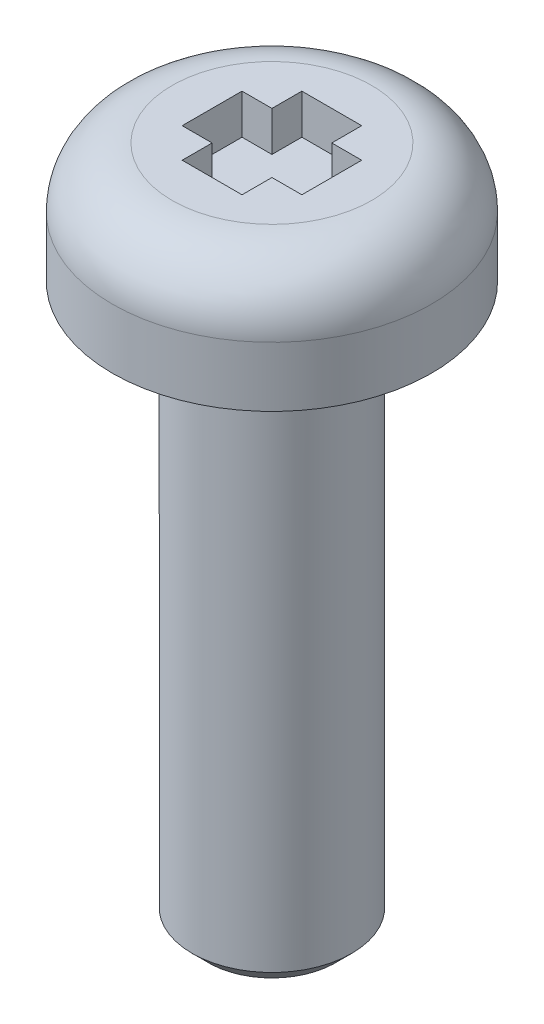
from build123d import *

# Parameters (mm, degrees)
SKETCH2_W               = 1.5
SKETCH2_H               = 3
CUT_EXTRUDE_THIN2_DEPTH = 1
CIRPATTERN1_COUNT       = 2
CIRPATTERN1_ANGLE       = 90
SKETCH3_R               = 2
BOSS_EXTRUDE1_DEPTH     = 14
FILLET1_R               = 0.4572
CHAMFER1_SIZE           = 0.4064


with BuildPart() as part:
    # Sketch1 → Base-Revolve (revolve)
    with BuildSketch(Plane.XY, mode=Mode.PRIVATE) as base_revolve_sk:
        with BuildLine():
            Line((4, 0), (0, 0))
            Line((0, 0), (0, 3))
            Line((0, 3), (2.5, 3))
            ThreePointArc((2.5, 3), (3.560660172, 2.560660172), (4, 1.5))
            Line((4, 1.5), (4, 0))
        make_face()
    revolve(base_revolve_sk.sketch.rotate(Axis((0, 11.592517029, 0), (0, -1, 0)), 90), axis=Axis((0, 11.592517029, 0), (0, -1, 0)))

    # Sketch2 → Cut-Extrude-Thin2 (cut)
    with BuildSketch(Plane(origin=(0, 3, 0), x_dir=(-1, 0, 0), z_dir=(0, 1, 0))):
        Rectangle(SKETCH2_W, SKETCH2_H)
    cut_extrude_thin2 = extrude(amount=-CUT_EXTRUDE_THIN2_DEPTH, mode=Mode.SUBTRACT)

    # CirPattern1: Cut-Extrude-Thin2 ×2 about axis
    cirpattern1_axis = Axis((0, 0, 0), (0, 1, 0))
    for i in range(1, CIRPATTERN1_COUNT):
        add(cut_extrude_thin2.rotate(cirpattern1_axis, i * CIRPATTERN1_ANGLE / (CIRPATTERN1_COUNT - 1)), mode=Mode.SUBTRACT)

    # Sketch3 → Boss-Extrude1 (add)
    with BuildSketch(Plane.XZ):
        with Locations(Location((0, 0, 0), (0, 0, 90))):
            Circle(SKETCH3_R)
    extrude(amount=BOSS_EXTRUDE1_DEPTH)

    # Fillet1
    fillet1_edges = [part.edges().sort_by_distance(p)[0] for p in [
        (0, 0, -2),
    ]]
    fillet(fillet1_edges, radius=FILLET1_R)

    # Chamfer1
    chamfer1_edges = [part.edges().sort_by_distance(p)[0] for p in [
        (0, -14, -2),
    ]]
    chamfer(chamfer1_edges, length=CHAMFER1_SIZE)


solid = part.part
